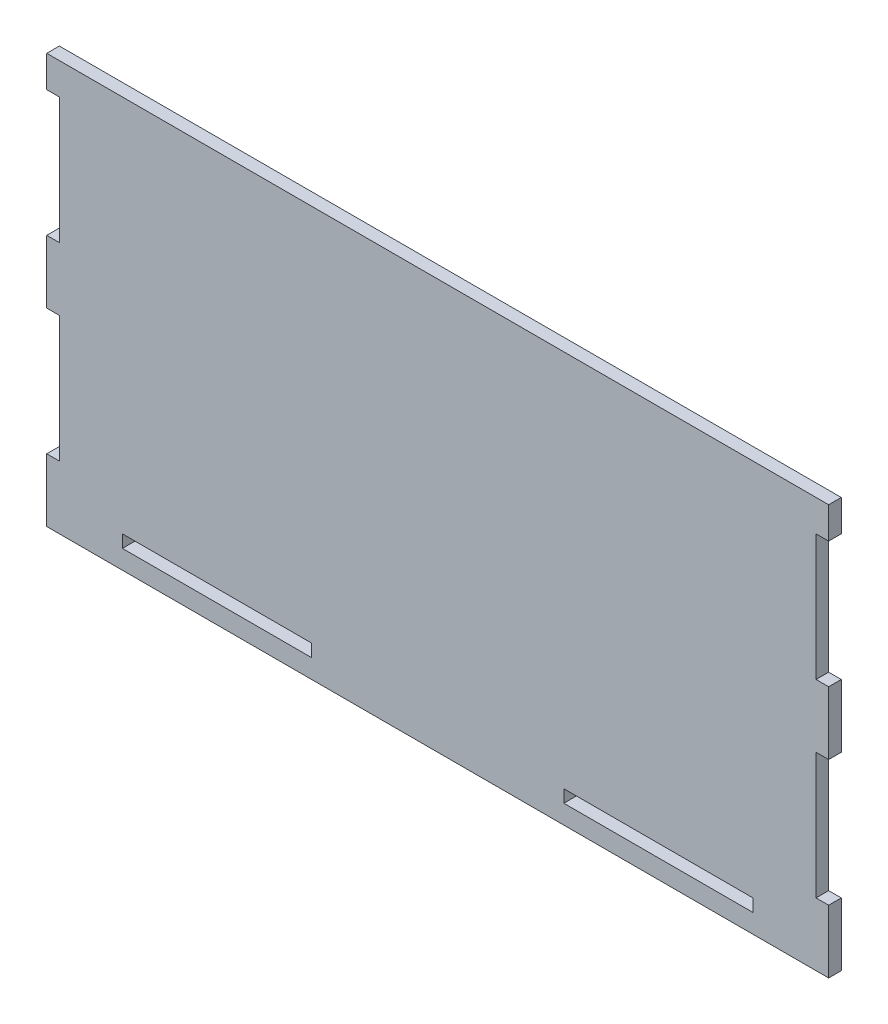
ISO-10303-21;
HEADER;
FILE_DESCRIPTION(('STEP AP214'),'2;1');
FILE_NAME('part.step','',(''),(''),'','','');
FILE_SCHEMA(('AUTOMOTIVE_DESIGN { 1 0 10303 214 1 1 1 1 }'));
ENDSEC;
DATA;
#1=APPLICATION_CONTEXT('core data for automotive mechanical design processes');
#2=APPLICATION_PROTOCOL_DEFINITION('international standard','automotive_design',2000,#1);
#3=PRODUCT_CONTEXT('',#1,'mechanical');
#4=PRODUCT('Part','Part','',(#3));
#5=PRODUCT_RELATED_PRODUCT_CATEGORY('part','',(#4));
#6=PRODUCT_DEFINITION_FORMATION('','',#4);
#7=PRODUCT_DEFINITION_CONTEXT('part definition',#1,'design');
#8=PRODUCT_DEFINITION('design','',#6,#7);
#9=PRODUCT_DEFINITION_SHAPE('','',#8);
#10=(LENGTH_UNIT() NAMED_UNIT(*) SI_UNIT(.MILLI.,.METRE.));
#11=(NAMED_UNIT(*) PLANE_ANGLE_UNIT() SI_UNIT($,.RADIAN.));
#12=(NAMED_UNIT(*) SI_UNIT($,.STERADIAN.) SOLID_ANGLE_UNIT());
#13=UNCERTAINTY_MEASURE_WITH_UNIT(LENGTH_MEASURE(1.E-05),#10,'distance_accuracy_value','');
#14=(GEOMETRIC_REPRESENTATION_CONTEXT(3) GLOBAL_UNCERTAINTY_ASSIGNED_CONTEXT((#13)) GLOBAL_UNIT_ASSIGNED_CONTEXT((#10,
#11,#12)) REPRESENTATION_CONTEXT('',''));
#15=CARTESIAN_POINT('',(0.,0.,0.));
#16=DIRECTION('',(0.,0.,1.));
#17=DIRECTION('',(1.,0.,0.));
#18=AXIS2_PLACEMENT_3D('',#15,#16,#17);
#19=CARTESIAN_POINT('',(0.,0.,20.));
#20=DIRECTION('',(0.,0.,-1.));
#21=DIRECTION('',(-1.,0.,0.));
#22=AXIS2_PLACEMENT_3D('',#19,#20,#21);
#23=PLANE('',#22);
#24=DIRECTION('',(0.,-1.,0.));
#25=VECTOR('',#24,1.);
#26=CARTESIAN_POINT('',(120.,30.,20.));
#27=LINE('',#26,#25);
#28=CARTESIAN_POINT('',(120.,50.,20.));
#29=VERTEX_POINT('',#28);
#30=CARTESIAN_POINT('',(120.,30.,20.));
#31=VERTEX_POINT('',#30);
#32=EDGE_CURVE('E260',#29,#31,#27,.T.);
#33=ORIENTED_EDGE('',*,*,#32,.F.);
#34=DIRECTION('',(-1.,0.,0.));
#35=VECTOR('',#34,1.);
#36=CARTESIAN_POINT('',(120.,50.,20.));
#37=LINE('',#36,#35);
#38=CARTESIAN_POINT('',(420.,50.,20.));
#39=VERTEX_POINT('',#38);
#40=EDGE_CURVE('E268',#39,#29,#37,.T.);
#41=ORIENTED_EDGE('',*,*,#40,.F.);
#42=DIRECTION('',(0.,1.,0.));
#43=VECTOR('',#42,1.);
#44=CARTESIAN_POINT('',(420.,30.,20.));
#45=LINE('',#44,#43);
#46=CARTESIAN_POINT('',(420.,30.,20.));
#47=VERTEX_POINT('',#46);
#48=EDGE_CURVE('E265',#47,#39,#45,.T.);
#49=ORIENTED_EDGE('',*,*,#48,.F.);
#50=DIRECTION('',(1.,0.,0.));
#51=VECTOR('',#50,1.);
#52=CARTESIAN_POINT('',(120.,30.,20.));
#53=LINE('',#52,#51);
#54=EDGE_CURVE('E262',#31,#47,#53,.T.);
#55=ORIENTED_EDGE('',*,*,#54,.F.);
#56=EDGE_LOOP('',(#33,#41,#49,#55));
#57=FACE_BOUND('',#56,.T.);
#58=DIRECTION('',(0.,-1.,0.));
#59=VECTOR('',#58,1.);
#60=CARTESIAN_POINT('',(0.,0.,20.));
#61=LINE('',#60,#59);
#62=CARTESIAN_POINT('',(0.,100.,20.));
#63=VERTEX_POINT('',#62);
#64=CARTESIAN_POINT('',(0.,0.,20.));
#65=VERTEX_POINT('',#64);
#66=EDGE_CURVE('E291',#63,#65,#61,.T.);
#67=ORIENTED_EDGE('',*,*,#66,.T.);
#68=DIRECTION('',(1.,0.,0.));
#69=VECTOR('',#68,1.);
#70=CARTESIAN_POINT('',(0.,0.,20.));
#71=LINE('',#70,#69);
#72=CARTESIAN_POINT('',(1240.,0.,20.));
#73=VERTEX_POINT('',#72);
#74=EDGE_CURVE('E294',#65,#73,#71,.T.);
#75=ORIENTED_EDGE('',*,*,#74,.T.);
#76=DIRECTION('',(0.,1.,0.));
#77=VECTOR('',#76,1.);
#78=CARTESIAN_POINT('',(1240.,0.,20.));
#79=LINE('',#78,#77);
#80=CARTESIAN_POINT('',(1240.,100.,20.));
#81=VERTEX_POINT('',#80);
#82=EDGE_CURVE('E297',#73,#81,#79,.T.);
#83=ORIENTED_EDGE('',*,*,#82,.T.);
#84=DIRECTION('',(-1.,0.,0.));
#85=VECTOR('',#84,1.);
#86=CARTESIAN_POINT('',(1240.,100.,20.));
#87=LINE('',#86,#85);
#88=CARTESIAN_POINT('',(1220.,100.,20.));
#89=VERTEX_POINT('',#88);
#90=EDGE_CURVE('E299',#81,#89,#87,.T.);
#91=ORIENTED_EDGE('',*,*,#90,.T.);
#92=DIRECTION('',(0.,1.,0.));
#93=VECTOR('',#92,1.);
#94=CARTESIAN_POINT('',(1220.,300.,20.));
#95=LINE('',#94,#93);
#96=CARTESIAN_POINT('',(1220.,300.,20.));
#97=VERTEX_POINT('',#96);
#98=EDGE_CURVE('E301',#89,#97,#95,.T.);
#99=ORIENTED_EDGE('',*,*,#98,.T.);
#100=DIRECTION('',(1.,0.,0.));
#101=VECTOR('',#100,1.);
#102=CARTESIAN_POINT('',(1240.,300.,20.));
#103=LINE('',#102,#101);
#104=CARTESIAN_POINT('',(1240.,300.,20.));
#105=VERTEX_POINT('',#104);
#106=EDGE_CURVE('E303',#97,#105,#103,.T.);
#107=ORIENTED_EDGE('',*,*,#106,.T.);
#108=DIRECTION('',(0.,1.,0.));
#109=VECTOR('',#108,1.);
#110=CARTESIAN_POINT('',(1240.,300.,20.));
#111=LINE('',#110,#109);
#112=CARTESIAN_POINT('',(1240.,400.,20.));
#113=VERTEX_POINT('',#112);
#114=EDGE_CURVE('E305',#105,#113,#111,.T.);
#115=ORIENTED_EDGE('',*,*,#114,.T.);
#116=DIRECTION('',(-1.,0.,0.));
#117=VECTOR('',#116,1.);
#118=CARTESIAN_POINT('',(1240.,400.,20.));
#119=LINE('',#118,#117);
#120=CARTESIAN_POINT('',(1220.,400.,20.));
#121=VERTEX_POINT('',#120);
#122=EDGE_CURVE('E307',#113,#121,#119,.T.);
#123=ORIENTED_EDGE('',*,*,#122,.T.);
#124=DIRECTION('',(0.,1.,0.));
#125=VECTOR('',#124,1.);
#126=CARTESIAN_POINT('',(1220.,600.,20.));
#127=LINE('',#126,#125);
#128=CARTESIAN_POINT('',(1220.,600.,20.));
#129=VERTEX_POINT('',#128);
#130=EDGE_CURVE('E309',#121,#129,#127,.T.);
#131=ORIENTED_EDGE('',*,*,#130,.T.);
#132=DIRECTION('',(1.,0.,0.));
#133=VECTOR('',#132,1.);
#134=CARTESIAN_POINT('',(1240.,600.,20.));
#135=LINE('',#134,#133);
#136=CARTESIAN_POINT('',(1240.,600.,20.));
#137=VERTEX_POINT('',#136);
#138=EDGE_CURVE('E311',#129,#137,#135,.T.);
#139=ORIENTED_EDGE('',*,*,#138,.T.);
#140=DIRECTION('',(0.,1.,0.));
#141=VECTOR('',#140,1.);
#142=CARTESIAN_POINT('',(1240.,600.,20.));
#143=LINE('',#142,#141);
#144=CARTESIAN_POINT('',(1240.,650.,20.));
#145=VERTEX_POINT('',#144);
#146=EDGE_CURVE('E313',#137,#145,#143,.T.);
#147=ORIENTED_EDGE('',*,*,#146,.T.);
#148=DIRECTION('',(-1.,0.,0.));
#149=VECTOR('',#148,1.);
#150=CARTESIAN_POINT('',(0.,650.,20.));
#151=LINE('',#150,#149);
#152=CARTESIAN_POINT('',(0.,650.,20.));
#153=VERTEX_POINT('',#152);
#154=EDGE_CURVE('E315',#145,#153,#151,.T.);
#155=ORIENTED_EDGE('',*,*,#154,.T.);
#156=DIRECTION('',(0.,-1.,0.));
#157=VECTOR('',#156,1.);
#158=CARTESIAN_POINT('',(0.,600.,20.));
#159=LINE('',#158,#157);
#160=CARTESIAN_POINT('',(0.,600.,20.));
#161=VERTEX_POINT('',#160);
#162=EDGE_CURVE('E317',#153,#161,#159,.T.);
#163=ORIENTED_EDGE('',*,*,#162,.T.);
#164=DIRECTION('',(1.,0.,0.));
#165=VECTOR('',#164,1.);
#166=CARTESIAN_POINT('',(0.,600.,20.));
#167=LINE('',#166,#165);
#168=CARTESIAN_POINT('',(20.,600.,20.));
#169=VERTEX_POINT('',#168);
#170=EDGE_CURVE('E319',#161,#169,#167,.T.);
#171=ORIENTED_EDGE('',*,*,#170,.T.);
#172=DIRECTION('',(0.,-1.,0.));
#173=VECTOR('',#172,1.);
#174=CARTESIAN_POINT('',(20.,600.,20.));
#175=LINE('',#174,#173);
#176=CARTESIAN_POINT('',(20.,400.,20.));
#177=VERTEX_POINT('',#176);
#178=EDGE_CURVE('E321',#169,#177,#175,.T.);
#179=ORIENTED_EDGE('',*,*,#178,.T.);
#180=DIRECTION('',(-1.,0.,0.));
#181=VECTOR('',#180,1.);
#182=CARTESIAN_POINT('',(0.,400.,20.));
#183=LINE('',#182,#181);
#184=CARTESIAN_POINT('',(0.,400.,20.));
#185=VERTEX_POINT('',#184);
#186=EDGE_CURVE('E323',#177,#185,#183,.T.);
#187=ORIENTED_EDGE('',*,*,#186,.T.);
#188=DIRECTION('',(0.,-1.,0.));
#189=VECTOR('',#188,1.);
#190=CARTESIAN_POINT('',(0.,300.,20.));
#191=LINE('',#190,#189);
#192=CARTESIAN_POINT('',(0.,300.,20.));
#193=VERTEX_POINT('',#192);
#194=EDGE_CURVE('E325',#185,#193,#191,.T.);
#195=ORIENTED_EDGE('',*,*,#194,.T.);
#196=DIRECTION('',(1.,0.,0.));
#197=VECTOR('',#196,1.);
#198=CARTESIAN_POINT('',(0.,300.,20.));
#199=LINE('',#198,#197);
#200=CARTESIAN_POINT('',(20.,300.,20.));
#201=VERTEX_POINT('',#200);
#202=EDGE_CURVE('E327',#193,#201,#199,.T.);
#203=ORIENTED_EDGE('',*,*,#202,.T.);
#204=DIRECTION('',(0.,-1.,0.));
#205=VECTOR('',#204,1.);
#206=CARTESIAN_POINT('',(20.,300.,20.));
#207=LINE('',#206,#205);
#208=CARTESIAN_POINT('',(20.0000000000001,100.,20.));
#209=VERTEX_POINT('',#208);
#210=EDGE_CURVE('E329',#201,#209,#207,.T.);
#211=ORIENTED_EDGE('',*,*,#210,.T.);
#212=DIRECTION('',(-1.,0.,0.));
#213=VECTOR('',#212,1.);
#214=CARTESIAN_POINT('',(0.,100.,20.));
#215=LINE('',#214,#213);
#216=EDGE_CURVE('E331',#209,#63,#215,.T.);
#217=ORIENTED_EDGE('',*,*,#216,.T.);
#218=EDGE_LOOP('',(#67,#75,#83,#91,#99,#107,#115,#123,#131,#139,#147,#155,#163,#171,#179,#187,
#195,#203,#211,#217));
#219=FACE_BOUND('',#218,.T.);
#220=DIRECTION('',(0.,-1.,0.));
#221=VECTOR('',#220,1.);
#222=CARTESIAN_POINT('',(820.,50.,20.));
#223=LINE('',#222,#221);
#224=CARTESIAN_POINT('',(820.,50.,20.));
#225=VERTEX_POINT('',#224);
#226=CARTESIAN_POINT('',(820.,30.,20.));
#227=VERTEX_POINT('',#226);
#228=EDGE_CURVE('E224',#225,#227,#223,.T.);
#229=ORIENTED_EDGE('',*,*,#228,.F.);
#230=DIRECTION('',(-1.,0.,0.));
#231=VECTOR('',#230,1.);
#232=CARTESIAN_POINT('',(820.,50.,20.));
#233=LINE('',#232,#231);
#234=CARTESIAN_POINT('',(1120.,50.,20.));
#235=VERTEX_POINT('',#234);
#236=EDGE_CURVE('E246',#235,#225,#233,.T.);
#237=ORIENTED_EDGE('',*,*,#236,.F.);
#238=DIRECTION('',(0.,1.,0.));
#239=VECTOR('',#238,1.);
#240=CARTESIAN_POINT('',(1120.,50.,20.));
#241=LINE('',#240,#239);
#242=CARTESIAN_POINT('',(1120.,30.,20.));
#243=VERTEX_POINT('',#242);
#244=EDGE_CURVE('E244',#243,#235,#241,.T.);
#245=ORIENTED_EDGE('',*,*,#244,.F.);
#246=DIRECTION('',(1.,0.,0.));
#247=VECTOR('',#246,1.);
#248=CARTESIAN_POINT('',(820.,30.,20.));
#249=LINE('',#248,#247);
#250=EDGE_CURVE('E232',#227,#243,#249,.T.);
#251=ORIENTED_EDGE('',*,*,#250,.F.);
#252=EDGE_LOOP('',(#229,#237,#245,#251));
#253=FACE_BOUND('',#252,.T.);
#254=ADVANCED_FACE('F39',(#57,#219,#253),#23,.F.);
#255=CARTESIAN_POINT('',(0.,0.,0.));
#256=DIRECTION('',(0.,0.,-1.));
#257=DIRECTION('',(-1.,0.,0.));
#258=AXIS2_PLACEMENT_3D('',#255,#256,#257);
#259=PLANE('',#258);
#260=DIRECTION('',(0.,-1.,0.));
#261=VECTOR('',#260,1.);
#262=CARTESIAN_POINT('',(0.,0.,0.));
#263=LINE('',#262,#261);
#264=CARTESIAN_POINT('',(0.,100.,0.));
#265=VERTEX_POINT('',#264);
#266=CARTESIAN_POINT('',(0.,0.,0.));
#267=VERTEX_POINT('',#266);
#268=EDGE_CURVE('E290',#265,#267,#263,.T.);
#269=ORIENTED_EDGE('',*,*,#268,.F.);
#270=DIRECTION('',(-1.,0.,0.));
#271=VECTOR('',#270,1.);
#272=CARTESIAN_POINT('',(0.,100.,0.));
#273=LINE('',#272,#271);
#274=CARTESIAN_POINT('',(20.0000000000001,100.,0.));
#275=VERTEX_POINT('',#274);
#276=EDGE_CURVE('E295',#275,#265,#273,.T.);
#277=ORIENTED_EDGE('',*,*,#276,.F.);
#278=DIRECTION('',(0.,-1.,0.));
#279=VECTOR('',#278,1.);
#280=CARTESIAN_POINT('',(20.,300.,0.));
#281=LINE('',#280,#279);
#282=CARTESIAN_POINT('',(20.,300.,0.));
#283=VERTEX_POINT('',#282);
#284=EDGE_CURVE('E370',#283,#275,#281,.T.);
#285=ORIENTED_EDGE('',*,*,#284,.F.);
#286=DIRECTION('',(1.,0.,0.));
#287=VECTOR('',#286,1.);
#288=CARTESIAN_POINT('',(0.,300.,0.));
#289=LINE('',#288,#287);
#290=CARTESIAN_POINT('',(0.,300.,0.));
#291=VERTEX_POINT('',#290);
#292=EDGE_CURVE('E368',#291,#283,#289,.T.);
#293=ORIENTED_EDGE('',*,*,#292,.F.);
#294=DIRECTION('',(0.,-1.,0.));
#295=VECTOR('',#294,1.);
#296=CARTESIAN_POINT('',(0.,300.,0.));
#297=LINE('',#296,#295);
#298=CARTESIAN_POINT('',(0.,400.,0.));
#299=VERTEX_POINT('',#298);
#300=EDGE_CURVE('E366',#299,#291,#297,.T.);
#301=ORIENTED_EDGE('',*,*,#300,.F.);
#302=DIRECTION('',(-1.,0.,0.));
#303=VECTOR('',#302,1.);
#304=CARTESIAN_POINT('',(0.,400.,0.));
#305=LINE('',#304,#303);
#306=CARTESIAN_POINT('',(20.,400.,0.));
#307=VERTEX_POINT('',#306);
#308=EDGE_CURVE('E364',#307,#299,#305,.T.);
#309=ORIENTED_EDGE('',*,*,#308,.F.);
#310=DIRECTION('',(0.,-1.,0.));
#311=VECTOR('',#310,1.);
#312=CARTESIAN_POINT('',(20.,600.,0.));
#313=LINE('',#312,#311);
#314=CARTESIAN_POINT('',(20.,600.,0.));
#315=VERTEX_POINT('',#314);
#316=EDGE_CURVE('E362',#315,#307,#313,.T.);
#317=ORIENTED_EDGE('',*,*,#316,.F.);
#318=DIRECTION('',(1.,0.,0.));
#319=VECTOR('',#318,1.);
#320=CARTESIAN_POINT('',(0.,600.,0.));
#321=LINE('',#320,#319);
#322=CARTESIAN_POINT('',(0.,600.,0.));
#323=VERTEX_POINT('',#322);
#324=EDGE_CURVE('E360',#323,#315,#321,.T.);
#325=ORIENTED_EDGE('',*,*,#324,.F.);
#326=DIRECTION('',(0.,-1.,0.));
#327=VECTOR('',#326,1.);
#328=CARTESIAN_POINT('',(0.,600.,0.));
#329=LINE('',#328,#327);
#330=CARTESIAN_POINT('',(0.,650.,0.));
#331=VERTEX_POINT('',#330);
#332=EDGE_CURVE('E358',#331,#323,#329,.T.);
#333=ORIENTED_EDGE('',*,*,#332,.F.);
#334=DIRECTION('',(-1.,0.,0.));
#335=VECTOR('',#334,1.);
#336=CARTESIAN_POINT('',(0.,650.,0.));
#337=LINE('',#336,#335);
#338=CARTESIAN_POINT('',(1240.,650.,0.));
#339=VERTEX_POINT('',#338);
#340=EDGE_CURVE('E356',#339,#331,#337,.T.);
#341=ORIENTED_EDGE('',*,*,#340,.F.);
#342=DIRECTION('',(0.,1.,0.));
#343=VECTOR('',#342,1.);
#344=CARTESIAN_POINT('',(1240.,600.,0.));
#345=LINE('',#344,#343);
#346=CARTESIAN_POINT('',(1240.,600.,0.));
#347=VERTEX_POINT('',#346);
#348=EDGE_CURVE('E354',#347,#339,#345,.T.);
#349=ORIENTED_EDGE('',*,*,#348,.F.);
#350=DIRECTION('',(1.,0.,0.));
#351=VECTOR('',#350,1.);
#352=CARTESIAN_POINT('',(1240.,600.,0.));
#353=LINE('',#352,#351);
#354=CARTESIAN_POINT('',(1220.,600.,0.));
#355=VERTEX_POINT('',#354);
#356=EDGE_CURVE('E352',#355,#347,#353,.T.);
#357=ORIENTED_EDGE('',*,*,#356,.F.);
#358=DIRECTION('',(0.,1.,0.));
#359=VECTOR('',#358,1.);
#360=CARTESIAN_POINT('',(1220.,600.,0.));
#361=LINE('',#360,#359);
#362=CARTESIAN_POINT('',(1220.,400.,0.));
#363=VERTEX_POINT('',#362);
#364=EDGE_CURVE('E350',#363,#355,#361,.T.);
#365=ORIENTED_EDGE('',*,*,#364,.F.);
#366=DIRECTION('',(-1.,0.,0.));
#367=VECTOR('',#366,1.);
#368=CARTESIAN_POINT('',(1240.,400.,0.));
#369=LINE('',#368,#367);
#370=CARTESIAN_POINT('',(1240.,400.,0.));
#371=VERTEX_POINT('',#370);
#372=EDGE_CURVE('E348',#371,#363,#369,.T.);
#373=ORIENTED_EDGE('',*,*,#372,.F.);
#374=DIRECTION('',(0.,1.,0.));
#375=VECTOR('',#374,1.);
#376=CARTESIAN_POINT('',(1240.,300.,0.));
#377=LINE('',#376,#375);
#378=CARTESIAN_POINT('',(1240.,300.,0.));
#379=VERTEX_POINT('',#378);
#380=EDGE_CURVE('E346',#379,#371,#377,.T.);
#381=ORIENTED_EDGE('',*,*,#380,.F.);
#382=DIRECTION('',(1.,0.,0.));
#383=VECTOR('',#382,1.);
#384=CARTESIAN_POINT('',(1240.,300.,0.));
#385=LINE('',#384,#383);
#386=CARTESIAN_POINT('',(1220.,300.,0.));
#387=VERTEX_POINT('',#386);
#388=EDGE_CURVE('E344',#387,#379,#385,.T.);
#389=ORIENTED_EDGE('',*,*,#388,.F.);
#390=DIRECTION('',(0.,1.,0.));
#391=VECTOR('',#390,1.);
#392=CARTESIAN_POINT('',(1220.,300.,0.));
#393=LINE('',#392,#391);
#394=CARTESIAN_POINT('',(1220.,100.,0.));
#395=VERTEX_POINT('',#394);
#396=EDGE_CURVE('E342',#395,#387,#393,.T.);
#397=ORIENTED_EDGE('',*,*,#396,.F.);
#398=DIRECTION('',(-1.,0.,0.));
#399=VECTOR('',#398,1.);
#400=CARTESIAN_POINT('',(1240.,100.,0.));
#401=LINE('',#400,#399);
#402=CARTESIAN_POINT('',(1240.,100.,0.));
#403=VERTEX_POINT('',#402);
#404=EDGE_CURVE('E340',#403,#395,#401,.T.);
#405=ORIENTED_EDGE('',*,*,#404,.F.);
#406=DIRECTION('',(0.,1.,0.));
#407=VECTOR('',#406,1.);
#408=CARTESIAN_POINT('',(1240.,0.,0.));
#409=LINE('',#408,#407);
#410=CARTESIAN_POINT('',(1240.,0.,0.));
#411=VERTEX_POINT('',#410);
#412=EDGE_CURVE('E338',#411,#403,#409,.T.);
#413=ORIENTED_EDGE('',*,*,#412,.F.);
#414=DIRECTION('',(1.,0.,0.));
#415=VECTOR('',#414,1.);
#416=CARTESIAN_POINT('',(0.,0.,0.));
#417=LINE('',#416,#415);
#418=EDGE_CURVE('E336',#267,#411,#417,.T.);
#419=ORIENTED_EDGE('',*,*,#418,.F.);
#420=EDGE_LOOP('',(#269,#277,#285,#293,#301,#309,#317,#325,#333,#341,#349,#357,#365,#373,#381,
#389,#397,#405,#413,#419));
#421=FACE_BOUND('',#420,.T.);
#422=DIRECTION('',(-1.,0.,0.));
#423=VECTOR('',#422,1.);
#424=CARTESIAN_POINT('',(120.,50.,0.));
#425=LINE('',#424,#423);
#426=CARTESIAN_POINT('',(420.,50.,0.));
#427=VERTEX_POINT('',#426);
#428=CARTESIAN_POINT('',(120.,50.,0.));
#429=VERTEX_POINT('',#428);
#430=EDGE_CURVE('E263',#427,#429,#425,.T.);
#431=ORIENTED_EDGE('',*,*,#430,.T.);
#432=DIRECTION('',(0.,-1.,0.));
#433=VECTOR('',#432,1.);
#434=CARTESIAN_POINT('',(120.,30.,0.));
#435=LINE('',#434,#433);
#436=CARTESIAN_POINT('',(120.,30.,0.));
#437=VERTEX_POINT('',#436);
#438=EDGE_CURVE('E240',#429,#437,#435,.T.);
#439=ORIENTED_EDGE('',*,*,#438,.T.);
#440=DIRECTION('',(1.,0.,0.));
#441=VECTOR('',#440,1.);
#442=CARTESIAN_POINT('',(120.,30.,0.));
#443=LINE('',#442,#441);
#444=CARTESIAN_POINT('',(420.,30.,0.));
#445=VERTEX_POINT('',#444);
#446=EDGE_CURVE('E273',#437,#445,#443,.T.);
#447=ORIENTED_EDGE('',*,*,#446,.T.);
#448=DIRECTION('',(0.,1.,0.));
#449=VECTOR('',#448,1.);
#450=CARTESIAN_POINT('',(420.,30.,0.));
#451=LINE('',#450,#449);
#452=EDGE_CURVE('E276',#445,#427,#451,.T.);
#453=ORIENTED_EDGE('',*,*,#452,.T.);
#454=EDGE_LOOP('',(#431,#439,#447,#453));
#455=FACE_BOUND('',#454,.T.);
#456=DIRECTION('',(-1.,0.,0.));
#457=VECTOR('',#456,1.);
#458=CARTESIAN_POINT('',(820.,50.,0.));
#459=LINE('',#458,#457);
#460=CARTESIAN_POINT('',(1120.,50.,0.));
#461=VERTEX_POINT('',#460);
#462=CARTESIAN_POINT('',(820.,50.,0.));
#463=VERTEX_POINT('',#462);
#464=EDGE_CURVE('E233',#461,#463,#459,.T.);
#465=ORIENTED_EDGE('',*,*,#464,.T.);
#466=DIRECTION('',(0.,-1.,0.));
#467=VECTOR('',#466,1.);
#468=CARTESIAN_POINT('',(820.,50.,0.));
#469=LINE('',#468,#467);
#470=CARTESIAN_POINT('',(820.,30.,0.));
#471=VERTEX_POINT('',#470);
#472=EDGE_CURVE('E62',#463,#471,#469,.T.);
#473=ORIENTED_EDGE('',*,*,#472,.T.);
#474=DIRECTION('',(1.,0.,0.));
#475=VECTOR('',#474,1.);
#476=CARTESIAN_POINT('',(820.,30.,0.));
#477=LINE('',#476,#475);
#478=CARTESIAN_POINT('',(1120.,30.,0.));
#479=VERTEX_POINT('',#478);
#480=EDGE_CURVE('E239',#471,#479,#477,.T.);
#481=ORIENTED_EDGE('',*,*,#480,.T.);
#482=DIRECTION('',(0.,1.,0.));
#483=VECTOR('',#482,1.);
#484=CARTESIAN_POINT('',(1120.,50.,0.));
#485=LINE('',#484,#483);
#486=EDGE_CURVE('E252',#479,#461,#485,.T.);
#487=ORIENTED_EDGE('',*,*,#486,.T.);
#488=EDGE_LOOP('',(#465,#473,#481,#487));
#489=FACE_BOUND('',#488,.T.);
#490=ADVANCED_FACE('F436',(#421,#455,#489),#259,.T.);
#491=CARTESIAN_POINT('',(0.,0.,20.));
#492=DIRECTION('',(1.,0.,0.));
#493=DIRECTION('',(0.,1.,0.));
#494=AXIS2_PLACEMENT_3D('',#491,#492,#493);
#495=PLANE('',#494);
#496=ORIENTED_EDGE('',*,*,#268,.T.);
#497=DIRECTION('',(0.,0.,-1.));
#498=VECTOR('',#497,1.);
#499=CARTESIAN_POINT('',(0.,0.,20.));
#500=LINE('',#499,#498);
#501=EDGE_CURVE('E11',#65,#267,#500,.T.);
#502=ORIENTED_EDGE('',*,*,#501,.F.);
#503=ORIENTED_EDGE('',*,*,#66,.F.);
#504=DIRECTION('',(0.,0.,-1.));
#505=VECTOR('',#504,1.);
#506=CARTESIAN_POINT('',(0.,100.,20.));
#507=LINE('',#506,#505);
#508=EDGE_CURVE('E333',#63,#265,#507,.T.);
#509=ORIENTED_EDGE('',*,*,#508,.T.);
#510=EDGE_LOOP('',(#496,#502,#503,#509));
#511=FACE_BOUND('',#510,.T.);
#512=ADVANCED_FACE('F41',(#511),#495,.F.);
#513=CARTESIAN_POINT('',(0.,0.,20.));
#514=DIRECTION('',(0.,1.,0.));
#515=DIRECTION('',(0.,0.,1.));
#516=AXIS2_PLACEMENT_3D('',#513,#514,#515);
#517=PLANE('',#516);
#518=ORIENTED_EDGE('',*,*,#418,.T.);
#519=DIRECTION('',(0.,0.,-1.));
#520=VECTOR('',#519,1.);
#521=CARTESIAN_POINT('',(1240.,0.,20.));
#522=LINE('',#521,#520);
#523=EDGE_CURVE('E47',#73,#411,#522,.T.);
#524=ORIENTED_EDGE('',*,*,#523,.F.);
#525=ORIENTED_EDGE('',*,*,#74,.F.);
#526=ORIENTED_EDGE('',*,*,#501,.T.);
#527=EDGE_LOOP('',(#518,#524,#525,#526));
#528=FACE_BOUND('',#527,.T.);
#529=ADVANCED_FACE('F453',(#528),#517,.F.);
#530=CARTESIAN_POINT('',(1240.,0.,20.));
#531=DIRECTION('',(-1.,0.,0.));
#532=DIRECTION('',(0.,0.,1.));
#533=AXIS2_PLACEMENT_3D('',#530,#531,#532);
#534=PLANE('',#533);
#535=ORIENTED_EDGE('',*,*,#412,.T.);
#536=DIRECTION('',(0.,0.,-1.));
#537=VECTOR('',#536,1.);
#538=CARTESIAN_POINT('',(1240.,100.,20.));
#539=LINE('',#538,#537);
#540=EDGE_CURVE('E423',#81,#403,#539,.T.);
#541=ORIENTED_EDGE('',*,*,#540,.F.);
#542=ORIENTED_EDGE('',*,*,#82,.F.);
#543=ORIENTED_EDGE('',*,*,#523,.T.);
#544=EDGE_LOOP('',(#535,#541,#542,#543));
#545=FACE_BOUND('',#544,.T.);
#546=ADVANCED_FACE('F430',(#545),#534,.F.);
#547=CARTESIAN_POINT('',(1240.,100.,20.));
#548=DIRECTION('',(0.,-1.,0.));
#549=DIRECTION('',(0.,0.,-1.));
#550=AXIS2_PLACEMENT_3D('',#547,#548,#549);
#551=PLANE('',#550);
#552=ORIENTED_EDGE('',*,*,#404,.T.);
#553=DIRECTION('',(0.,0.,-1.));
#554=VECTOR('',#553,1.);
#555=CARTESIAN_POINT('',(1220.,100.,20.));
#556=LINE('',#555,#554);
#557=EDGE_CURVE('E420',#89,#395,#556,.T.);
#558=ORIENTED_EDGE('',*,*,#557,.F.);
#559=ORIENTED_EDGE('',*,*,#90,.F.);
#560=ORIENTED_EDGE('',*,*,#540,.T.);
#561=EDGE_LOOP('',(#552,#558,#559,#560));
#562=FACE_BOUND('',#561,.T.);
#563=ADVANCED_FACE('F442',(#562),#551,.F.);
#564=CARTESIAN_POINT('',(1220.,300.,20.));
#565=DIRECTION('',(-1.,0.,0.));
#566=DIRECTION('',(0.,0.,1.));
#567=AXIS2_PLACEMENT_3D('',#564,#565,#566);
#568=PLANE('',#567);
#569=ORIENTED_EDGE('',*,*,#396,.T.);
#570=DIRECTION('',(0.,0.,-1.));
#571=VECTOR('',#570,1.);
#572=CARTESIAN_POINT('',(1220.,300.,20.));
#573=LINE('',#572,#571);
#574=EDGE_CURVE('E417',#97,#387,#573,.T.);
#575=ORIENTED_EDGE('',*,*,#574,.F.);
#576=ORIENTED_EDGE('',*,*,#98,.F.);
#577=ORIENTED_EDGE('',*,*,#557,.T.);
#578=EDGE_LOOP('',(#569,#575,#576,#577));
#579=FACE_BOUND('',#578,.T.);
#580=ADVANCED_FACE('F446',(#579),#568,.F.);
#581=CARTESIAN_POINT('',(1240.,300.,20.));
#582=DIRECTION('',(0.,1.,0.));
#583=DIRECTION('',(0.,0.,1.));
#584=AXIS2_PLACEMENT_3D('',#581,#582,#583);
#585=PLANE('',#584);
#586=ORIENTED_EDGE('',*,*,#388,.T.);
#587=DIRECTION('',(0.,0.,-1.));
#588=VECTOR('',#587,1.);
#589=CARTESIAN_POINT('',(1240.,300.,20.));
#590=LINE('',#589,#588);
#591=EDGE_CURVE('E414',#105,#379,#590,.T.);
#592=ORIENTED_EDGE('',*,*,#591,.F.);
#593=ORIENTED_EDGE('',*,*,#106,.F.);
#594=ORIENTED_EDGE('',*,*,#574,.T.);
#595=EDGE_LOOP('',(#586,#592,#593,#594));
#596=FACE_BOUND('',#595,.T.);
#597=ADVANCED_FACE('F526',(#596),#585,.F.);
#598=CARTESIAN_POINT('',(1240.,300.,20.));
#599=DIRECTION('',(-1.,0.,0.));
#600=DIRECTION('',(0.,0.,1.));
#601=AXIS2_PLACEMENT_3D('',#598,#599,#600);
#602=PLANE('',#601);
#603=ORIENTED_EDGE('',*,*,#380,.T.);
#604=DIRECTION('',(0.,0.,-1.));
#605=VECTOR('',#604,1.);
#606=CARTESIAN_POINT('',(1240.,400.,20.));
#607=LINE('',#606,#605);
#608=EDGE_CURVE('E411',#113,#371,#607,.T.);
#609=ORIENTED_EDGE('',*,*,#608,.F.);
#610=ORIENTED_EDGE('',*,*,#114,.F.);
#611=ORIENTED_EDGE('',*,*,#591,.T.);
#612=EDGE_LOOP('',(#603,#609,#610,#611));
#613=FACE_BOUND('',#612,.T.);
#614=ADVANCED_FACE('F524',(#613),#602,.F.);
#615=CARTESIAN_POINT('',(1240.,400.,20.));
#616=DIRECTION('',(0.,-1.,0.));
#617=DIRECTION('',(0.,0.,-1.));
#618=AXIS2_PLACEMENT_3D('',#615,#616,#617);
#619=PLANE('',#618);
#620=ORIENTED_EDGE('',*,*,#372,.T.);
#621=DIRECTION('',(0.,0.,-1.));
#622=VECTOR('',#621,1.);
#623=CARTESIAN_POINT('',(1220.,400.,20.));
#624=LINE('',#623,#622);
#625=EDGE_CURVE('E408',#121,#363,#624,.T.);
#626=ORIENTED_EDGE('',*,*,#625,.F.);
#627=ORIENTED_EDGE('',*,*,#122,.F.);
#628=ORIENTED_EDGE('',*,*,#608,.T.);
#629=EDGE_LOOP('',(#620,#626,#627,#628));
#630=FACE_BOUND('',#629,.T.);
#631=ADVANCED_FACE('F519',(#630),#619,.F.);
#632=CARTESIAN_POINT('',(1220.,600.,20.));
#633=DIRECTION('',(-1.,0.,0.));
#634=DIRECTION('',(0.,0.,1.));
#635=AXIS2_PLACEMENT_3D('',#632,#633,#634);
#636=PLANE('',#635);
#637=ORIENTED_EDGE('',*,*,#364,.T.);
#638=DIRECTION('',(0.,0.,-1.));
#639=VECTOR('',#638,1.);
#640=CARTESIAN_POINT('',(1220.,600.,20.));
#641=LINE('',#640,#639);
#642=EDGE_CURVE('E405',#129,#355,#641,.T.);
#643=ORIENTED_EDGE('',*,*,#642,.F.);
#644=ORIENTED_EDGE('',*,*,#130,.F.);
#645=ORIENTED_EDGE('',*,*,#625,.T.);
#646=EDGE_LOOP('',(#637,#643,#644,#645));
#647=FACE_BOUND('',#646,.T.);
#648=ADVANCED_FACE('F514',(#647),#636,.F.);
#649=CARTESIAN_POINT('',(1240.,600.,20.));
#650=DIRECTION('',(0.,1.,0.));
#651=DIRECTION('',(0.,0.,1.));
#652=AXIS2_PLACEMENT_3D('',#649,#650,#651);
#653=PLANE('',#652);
#654=ORIENTED_EDGE('',*,*,#356,.T.);
#655=DIRECTION('',(0.,0.,-1.));
#656=VECTOR('',#655,1.);
#657=CARTESIAN_POINT('',(1240.,600.,20.));
#658=LINE('',#657,#656);
#659=EDGE_CURVE('E402',#137,#347,#658,.T.);
#660=ORIENTED_EDGE('',*,*,#659,.F.);
#661=ORIENTED_EDGE('',*,*,#138,.F.);
#662=ORIENTED_EDGE('',*,*,#642,.T.);
#663=EDGE_LOOP('',(#654,#660,#661,#662));
#664=FACE_BOUND('',#663,.T.);
#665=ADVANCED_FACE('F510',(#664),#653,.F.);
#666=CARTESIAN_POINT('',(1240.,600.,20.));
#667=DIRECTION('',(-1.,0.,0.));
#668=DIRECTION('',(0.,0.,1.));
#669=AXIS2_PLACEMENT_3D('',#666,#667,#668);
#670=PLANE('',#669);
#671=ORIENTED_EDGE('',*,*,#348,.T.);
#672=DIRECTION('',(0.,0.,-1.));
#673=VECTOR('',#672,1.);
#674=CARTESIAN_POINT('',(1240.,650.,20.));
#675=LINE('',#674,#673);
#676=EDGE_CURVE('E399',#145,#339,#675,.T.);
#677=ORIENTED_EDGE('',*,*,#676,.F.);
#678=ORIENTED_EDGE('',*,*,#146,.F.);
#679=ORIENTED_EDGE('',*,*,#659,.T.);
#680=EDGE_LOOP('',(#671,#677,#678,#679));
#681=FACE_BOUND('',#680,.T.);
#682=ADVANCED_FACE('F505',(#681),#670,.F.);
#683=CARTESIAN_POINT('',(0.,650.,20.));
#684=DIRECTION('',(0.,-1.,0.));
#685=DIRECTION('',(0.,0.,-1.));
#686=AXIS2_PLACEMENT_3D('',#683,#684,#685);
#687=PLANE('',#686);
#688=ORIENTED_EDGE('',*,*,#340,.T.);
#689=DIRECTION('',(0.,0.,-1.));
#690=VECTOR('',#689,1.);
#691=CARTESIAN_POINT('',(0.,650.,20.));
#692=LINE('',#691,#690);
#693=EDGE_CURVE('E396',#153,#331,#692,.T.);
#694=ORIENTED_EDGE('',*,*,#693,.F.);
#695=ORIENTED_EDGE('',*,*,#154,.F.);
#696=ORIENTED_EDGE('',*,*,#676,.T.);
#697=EDGE_LOOP('',(#688,#694,#695,#696));
#698=FACE_BOUND('',#697,.T.);
#699=ADVANCED_FACE('F499',(#698),#687,.F.);
#700=CARTESIAN_POINT('',(0.,600.,20.));
#701=DIRECTION('',(1.,0.,0.));
#702=DIRECTION('',(0.,1.,0.));
#703=AXIS2_PLACEMENT_3D('',#700,#701,#702);
#704=PLANE('',#703);
#705=ORIENTED_EDGE('',*,*,#332,.T.);
#706=DIRECTION('',(0.,0.,-1.));
#707=VECTOR('',#706,1.);
#708=CARTESIAN_POINT('',(0.,600.,20.));
#709=LINE('',#708,#707);
#710=EDGE_CURVE('E393',#161,#323,#709,.T.);
#711=ORIENTED_EDGE('',*,*,#710,.F.);
#712=ORIENTED_EDGE('',*,*,#162,.F.);
#713=ORIENTED_EDGE('',*,*,#693,.T.);
#714=EDGE_LOOP('',(#705,#711,#712,#713));
#715=FACE_BOUND('',#714,.T.);
#716=ADVANCED_FACE('F495',(#715),#704,.F.);
#717=CARTESIAN_POINT('',(0.,600.,20.));
#718=DIRECTION('',(0.,1.,0.));
#719=DIRECTION('',(0.,0.,1.));
#720=AXIS2_PLACEMENT_3D('',#717,#718,#719);
#721=PLANE('',#720);
#722=ORIENTED_EDGE('',*,*,#324,.T.);
#723=DIRECTION('',(0.,0.,-1.));
#724=VECTOR('',#723,1.);
#725=CARTESIAN_POINT('',(20.,600.,20.));
#726=LINE('',#725,#724);
#727=EDGE_CURVE('E390',#169,#315,#726,.T.);
#728=ORIENTED_EDGE('',*,*,#727,.F.);
#729=ORIENTED_EDGE('',*,*,#170,.F.);
#730=ORIENTED_EDGE('',*,*,#710,.T.);
#731=EDGE_LOOP('',(#722,#728,#729,#730));
#732=FACE_BOUND('',#731,.T.);
#733=ADVANCED_FACE('F490',(#732),#721,.F.);
#734=CARTESIAN_POINT('',(20.,600.,20.));
#735=DIRECTION('',(1.,0.,0.));
#736=DIRECTION('',(0.,1.,0.));
#737=AXIS2_PLACEMENT_3D('',#734,#735,#736);
#738=PLANE('',#737);
#739=ORIENTED_EDGE('',*,*,#316,.T.);
#740=DIRECTION('',(0.,0.,-1.));
#741=VECTOR('',#740,1.);
#742=CARTESIAN_POINT('',(20.,400.,20.));
#743=LINE('',#742,#741);
#744=EDGE_CURVE('E387',#177,#307,#743,.T.);
#745=ORIENTED_EDGE('',*,*,#744,.F.);
#746=ORIENTED_EDGE('',*,*,#178,.F.);
#747=ORIENTED_EDGE('',*,*,#727,.T.);
#748=EDGE_LOOP('',(#739,#745,#746,#747));
#749=FACE_BOUND('',#748,.T.);
#750=ADVANCED_FACE('F484',(#749),#738,.F.);
#751=CARTESIAN_POINT('',(0.,400.,20.));
#752=DIRECTION('',(0.,-1.,0.));
#753=DIRECTION('',(0.,0.,-1.));
#754=AXIS2_PLACEMENT_3D('',#751,#752,#753);
#755=PLANE('',#754);
#756=ORIENTED_EDGE('',*,*,#308,.T.);
#757=DIRECTION('',(0.,0.,-1.));
#758=VECTOR('',#757,1.);
#759=CARTESIAN_POINT('',(0.,400.,20.));
#760=LINE('',#759,#758);
#761=EDGE_CURVE('E384',#185,#299,#760,.T.);
#762=ORIENTED_EDGE('',*,*,#761,.F.);
#763=ORIENTED_EDGE('',*,*,#186,.F.);
#764=ORIENTED_EDGE('',*,*,#744,.T.);
#765=EDGE_LOOP('',(#756,#762,#763,#764));
#766=FACE_BOUND('',#765,.T.);
#767=ADVANCED_FACE('F480',(#766),#755,.F.);
#768=CARTESIAN_POINT('',(0.,300.,20.));
#769=DIRECTION('',(1.,0.,0.));
#770=DIRECTION('',(0.,1.,0.));
#771=AXIS2_PLACEMENT_3D('',#768,#769,#770);
#772=PLANE('',#771);
#773=ORIENTED_EDGE('',*,*,#300,.T.);
#774=DIRECTION('',(0.,0.,-1.));
#775=VECTOR('',#774,1.);
#776=CARTESIAN_POINT('',(0.,300.,20.));
#777=LINE('',#776,#775);
#778=EDGE_CURVE('E381',#193,#291,#777,.T.);
#779=ORIENTED_EDGE('',*,*,#778,.F.);
#780=ORIENTED_EDGE('',*,*,#194,.F.);
#781=ORIENTED_EDGE('',*,*,#761,.T.);
#782=EDGE_LOOP('',(#773,#779,#780,#781));
#783=FACE_BOUND('',#782,.T.);
#784=ADVANCED_FACE('F475',(#783),#772,.F.);
#785=CARTESIAN_POINT('',(0.,300.,20.));
#786=DIRECTION('',(0.,1.,0.));
#787=DIRECTION('',(0.,0.,1.));
#788=AXIS2_PLACEMENT_3D('',#785,#786,#787);
#789=PLANE('',#788);
#790=ORIENTED_EDGE('',*,*,#292,.T.);
#791=DIRECTION('',(0.,0.,-1.));
#792=VECTOR('',#791,1.);
#793=CARTESIAN_POINT('',(20.,300.,20.));
#794=LINE('',#793,#792);
#795=EDGE_CURVE('E378',#201,#283,#794,.T.);
#796=ORIENTED_EDGE('',*,*,#795,.F.);
#797=ORIENTED_EDGE('',*,*,#202,.F.);
#798=ORIENTED_EDGE('',*,*,#778,.T.);
#799=EDGE_LOOP('',(#790,#796,#797,#798));
#800=FACE_BOUND('',#799,.T.);
#801=ADVANCED_FACE('F469',(#800),#789,.F.);
#802=CARTESIAN_POINT('',(20.,300.,20.));
#803=DIRECTION('',(1.,0.,0.));
#804=DIRECTION('',(0.,1.,0.));
#805=AXIS2_PLACEMENT_3D('',#802,#803,#804);
#806=PLANE('',#805);
#807=ORIENTED_EDGE('',*,*,#284,.T.);
#808=DIRECTION('',(0.,0.,-1.));
#809=VECTOR('',#808,1.);
#810=CARTESIAN_POINT('',(20.0000000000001,100.,20.));
#811=LINE('',#810,#809);
#812=EDGE_CURVE('E375',#209,#275,#811,.T.);
#813=ORIENTED_EDGE('',*,*,#812,.F.);
#814=ORIENTED_EDGE('',*,*,#210,.F.);
#815=ORIENTED_EDGE('',*,*,#795,.T.);
#816=EDGE_LOOP('',(#807,#813,#814,#815));
#817=FACE_BOUND('',#816,.T.);
#818=ADVANCED_FACE('F465',(#817),#806,.F.);
#819=CARTESIAN_POINT('',(0.,100.,20.));
#820=DIRECTION('',(0.,-1.,0.));
#821=DIRECTION('',(0.,0.,-1.));
#822=AXIS2_PLACEMENT_3D('',#819,#820,#821);
#823=PLANE('',#822);
#824=ORIENTED_EDGE('',*,*,#276,.T.);
#825=ORIENTED_EDGE('',*,*,#508,.F.);
#826=ORIENTED_EDGE('',*,*,#216,.F.);
#827=ORIENTED_EDGE('',*,*,#812,.T.);
#828=EDGE_LOOP('',(#824,#825,#826,#827));
#829=FACE_BOUND('',#828,.T.);
#830=ADVANCED_FACE('F460',(#829),#823,.F.);
#831=CARTESIAN_POINT('',(120.,30.,20.));
#832=DIRECTION('',(1.,0.,0.));
#833=DIRECTION('',(0.,0.,-1.));
#834=AXIS2_PLACEMENT_3D('',#831,#832,#833);
#835=PLANE('',#834);
#836=ORIENTED_EDGE('',*,*,#438,.F.);
#837=DIRECTION('',(0.,0.,-1.));
#838=VECTOR('',#837,1.);
#839=CARTESIAN_POINT('',(120.,50.,20.));
#840=LINE('',#839,#838);
#841=EDGE_CURVE('E270',#29,#429,#840,.T.);
#842=ORIENTED_EDGE('',*,*,#841,.F.);
#843=ORIENTED_EDGE('',*,*,#32,.T.);
#844=DIRECTION('',(0.,0.,-1.));
#845=VECTOR('',#844,1.);
#846=CARTESIAN_POINT('',(120.,30.,20.));
#847=LINE('',#846,#845);
#848=EDGE_CURVE('E287',#31,#437,#847,.T.);
#849=ORIENTED_EDGE('',*,*,#848,.T.);
#850=EDGE_LOOP('',(#836,#842,#843,#849));
#851=FACE_BOUND('',#850,.T.);
#852=ADVANCED_FACE('F544',(#851),#835,.T.);
#853=CARTESIAN_POINT('',(120.,30.,20.));
#854=DIRECTION('',(0.,1.,0.));
#855=DIRECTION('',(0.,0.,1.));
#856=AXIS2_PLACEMENT_3D('',#853,#854,#855);
#857=PLANE('',#856);
#858=ORIENTED_EDGE('',*,*,#446,.F.);
#859=ORIENTED_EDGE('',*,*,#848,.F.);
#860=ORIENTED_EDGE('',*,*,#54,.T.);
#861=DIRECTION('',(0.,0.,-1.));
#862=VECTOR('',#861,1.);
#863=CARTESIAN_POINT('',(420.,30.,20.));
#864=LINE('',#863,#862);
#865=EDGE_CURVE('E285',#47,#445,#864,.T.);
#866=ORIENTED_EDGE('',*,*,#865,.T.);
#867=EDGE_LOOP('',(#858,#859,#860,#866));
#868=FACE_BOUND('',#867,.T.);
#869=ADVANCED_FACE('F643',(#868),#857,.T.);
#870=CARTESIAN_POINT('',(420.,30.,20.));
#871=DIRECTION('',(-1.,0.,0.));
#872=DIRECTION('',(0.,0.,1.));
#873=AXIS2_PLACEMENT_3D('',#870,#871,#872);
#874=PLANE('',#873);
#875=ORIENTED_EDGE('',*,*,#452,.F.);
#876=ORIENTED_EDGE('',*,*,#865,.F.);
#877=ORIENTED_EDGE('',*,*,#48,.T.);
#878=DIRECTION('',(0.,0.,-1.));
#879=VECTOR('',#878,1.);
#880=CARTESIAN_POINT('',(420.,50.,20.));
#881=LINE('',#880,#879);
#882=EDGE_CURVE('E283',#39,#427,#881,.T.);
#883=ORIENTED_EDGE('',*,*,#882,.T.);
#884=EDGE_LOOP('',(#875,#876,#877,#883));
#885=FACE_BOUND('',#884,.T.);
#886=ADVANCED_FACE('F651',(#885),#874,.T.);
#887=CARTESIAN_POINT('',(120.,50.,20.));
#888=DIRECTION('',(0.,-1.,0.));
#889=DIRECTION('',(0.,0.,-1.));
#890=AXIS2_PLACEMENT_3D('',#887,#888,#889);
#891=PLANE('',#890);
#892=ORIENTED_EDGE('',*,*,#430,.F.);
#893=ORIENTED_EDGE('',*,*,#882,.F.);
#894=ORIENTED_EDGE('',*,*,#40,.T.);
#895=ORIENTED_EDGE('',*,*,#841,.T.);
#896=EDGE_LOOP('',(#892,#893,#894,#895));
#897=FACE_BOUND('',#896,.T.);
#898=ADVANCED_FACE('F659',(#897),#891,.T.);
#899=CARTESIAN_POINT('',(820.,50.,20.));
#900=DIRECTION('',(1.,0.,0.));
#901=DIRECTION('',(0.,0.,-1.));
#902=AXIS2_PLACEMENT_3D('',#899,#900,#901);
#903=PLANE('',#902);
#904=ORIENTED_EDGE('',*,*,#472,.F.);
#905=DIRECTION('',(0.,0.,-1.));
#906=VECTOR('',#905,1.);
#907=CARTESIAN_POINT('',(820.,50.,20.));
#908=LINE('',#907,#906);
#909=EDGE_CURVE('E228',#225,#463,#908,.T.);
#910=ORIENTED_EDGE('',*,*,#909,.F.);
#911=ORIENTED_EDGE('',*,*,#228,.T.);
#912=DIRECTION('',(0.,0.,-1.));
#913=VECTOR('',#912,1.);
#914=CARTESIAN_POINT('',(820.,30.,20.));
#915=LINE('',#914,#913);
#916=EDGE_CURVE('E227',#227,#471,#915,.T.);
#917=ORIENTED_EDGE('',*,*,#916,.T.);
#918=EDGE_LOOP('',(#904,#910,#911,#917));
#919=FACE_BOUND('',#918,.T.);
#920=ADVANCED_FACE('F226',(#919),#903,.T.);
#921=CARTESIAN_POINT('',(820.,30.,20.));
#922=DIRECTION('',(0.,1.,0.));
#923=DIRECTION('',(0.,0.,1.));
#924=AXIS2_PLACEMENT_3D('',#921,#922,#923);
#925=PLANE('',#924);
#926=ORIENTED_EDGE('',*,*,#480,.F.);
#927=ORIENTED_EDGE('',*,*,#916,.F.);
#928=ORIENTED_EDGE('',*,*,#250,.T.);
#929=DIRECTION('',(0.,0.,-1.));
#930=VECTOR('',#929,1.);
#931=CARTESIAN_POINT('',(1120.,30.,20.));
#932=LINE('',#931,#930);
#933=EDGE_CURVE('E241',#243,#479,#932,.T.);
#934=ORIENTED_EDGE('',*,*,#933,.T.);
#935=EDGE_LOOP('',(#926,#927,#928,#934));
#936=FACE_BOUND('',#935,.T.);
#937=ADVANCED_FACE('F236',(#936),#925,.T.);
#938=CARTESIAN_POINT('',(1120.,50.,20.));
#939=DIRECTION('',(-1.,0.,0.));
#940=DIRECTION('',(0.,0.,1.));
#941=AXIS2_PLACEMENT_3D('',#938,#939,#940);
#942=PLANE('',#941);
#943=ORIENTED_EDGE('',*,*,#486,.F.);
#944=ORIENTED_EDGE('',*,*,#933,.F.);
#945=ORIENTED_EDGE('',*,*,#244,.T.);
#946=DIRECTION('',(0.,0.,-1.));
#947=VECTOR('',#946,1.);
#948=CARTESIAN_POINT('',(1120.,50.,20.));
#949=LINE('',#948,#947);
#950=EDGE_CURVE('E54',#235,#461,#949,.T.);
#951=ORIENTED_EDGE('',*,*,#950,.T.);
#952=EDGE_LOOP('',(#943,#944,#945,#951));
#953=FACE_BOUND('',#952,.T.);
#954=ADVANCED_FACE('F683',(#953),#942,.T.);
#955=CARTESIAN_POINT('',(820.,50.,20.));
#956=DIRECTION('',(0.,-1.,0.));
#957=DIRECTION('',(0.,0.,-1.));
#958=AXIS2_PLACEMENT_3D('',#955,#956,#957);
#959=PLANE('',#958);
#960=ORIENTED_EDGE('',*,*,#464,.F.);
#961=ORIENTED_EDGE('',*,*,#950,.F.);
#962=ORIENTED_EDGE('',*,*,#236,.T.);
#963=ORIENTED_EDGE('',*,*,#909,.T.);
#964=EDGE_LOOP('',(#960,#961,#962,#963));
#965=FACE_BOUND('',#964,.T.);
#966=ADVANCED_FACE('F691',(#965),#959,.T.);
#967=CLOSED_SHELL('',(#254,#490,#512,#529,#546,#563,#580,#597,#614,#631,#648,#665,#682,#699,
#716,#733,#750,#767,#784,#801,#818,#830,#852,#869,#886,#898,#920,#937,#954,#966));
#968=MANIFOLD_SOLID_BREP('B2',#967);
#969=ADVANCED_BREP_SHAPE_REPRESENTATION('',(#18,#968),#14);
#970=SHAPE_DEFINITION_REPRESENTATION(#9,#969);
ENDSEC;
END-ISO-10303-21;
